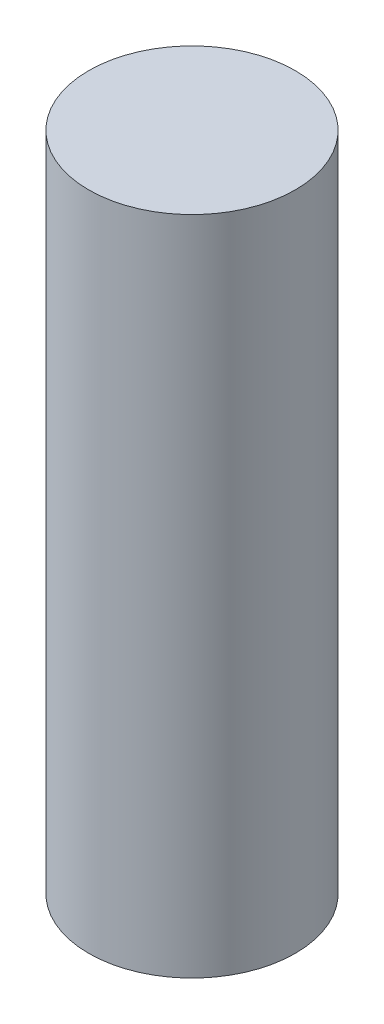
from build123d import *

# Parameters (mm, degrees)
ESQUISSE1_R      = 50
EXTRUSION1_DEPTH = 320


with BuildPart() as part:
    # Esquisse1 → Extrusion1 (new body)
    with BuildSketch(Plane(origin=(0, 0, 0), x_dir=(1, 0, 0), z_dir=(0, 1, 0))):
        with Locations(Location((0, 0, 0), (0, 0, 90))):
            Circle(ESQUISSE1_R)
    extrude(amount=EXTRUSION1_DEPTH)


solid = part.part
